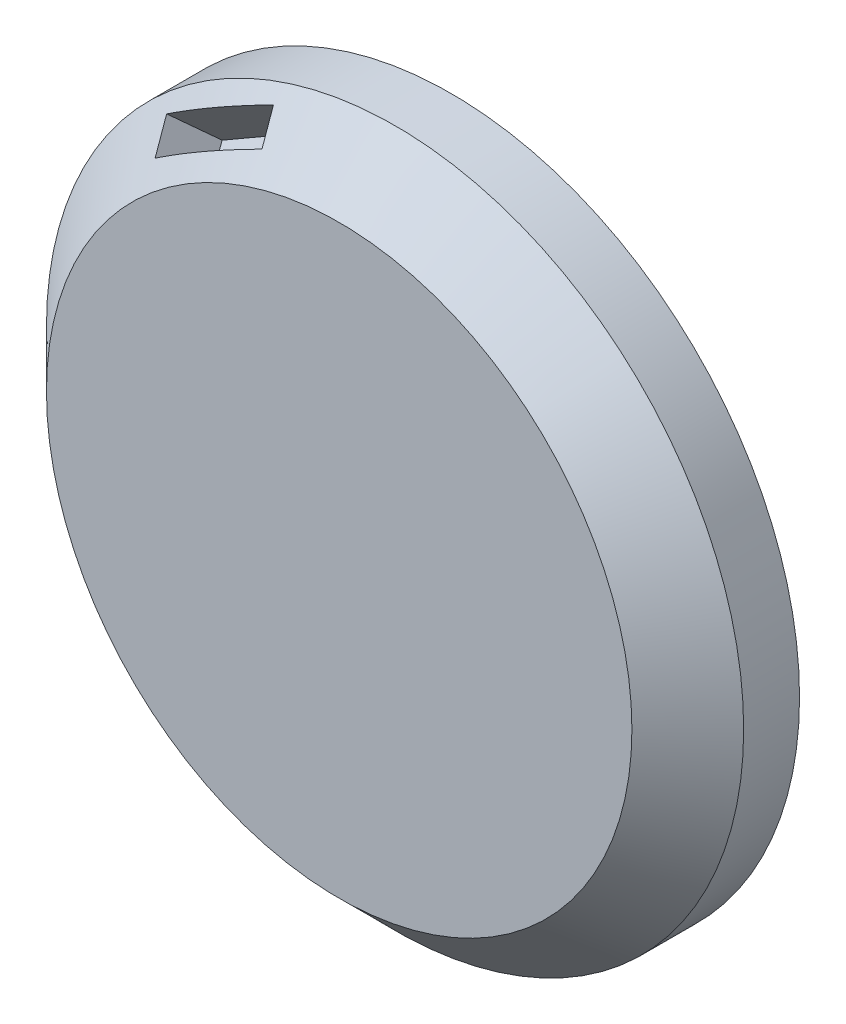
from build123d import *

# Parameters (mm, degrees)
SKIZZE1_R                       = 62.389337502
LINEAR_AUSTRAGEN1_DEPTH         = 20
FASE1_SIZE                      = 10
SKIZZE2_W                       = 21.888684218
SKIZZE2_H                       = 5.986648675
SCHNITT_LINEAR_AUSTRAGEN1_DEPTH = 10


with BuildPart() as part:
    # Skizze1 → Linear austragen1 (new body)
    with BuildSketch(Plane.XY):
        Circle(SKIZZE1_R)
    extrude(amount=-LINEAR_AUSTRAGEN1_DEPTH)

    # Fase1
    fase1_edges = [part.edges().sort_by_distance(p)[0] for p in [
        (-62.389337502, 0, 0),
    ]]
    chamfer(fase1_edges, length=FASE1_SIZE)

    # Skizze2 → Schnitt-Linear austragen1 (cut)
    with BuildSketch(Plane(origin=(-28.694668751, 49.700624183, -5), x_dir=(-0.8660254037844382, -0.5000000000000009, 0), z_dir=(-0.3535533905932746, 0.6123724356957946, 0.7071067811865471))):
        with Locations((-0.572675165, -0.178249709)):
            Rectangle(SKIZZE2_W, SKIZZE2_H)
    extrude(amount=-SCHNITT_LINEAR_AUSTRAGEN1_DEPTH, mode=Mode.SUBTRACT)


solid = part.part
